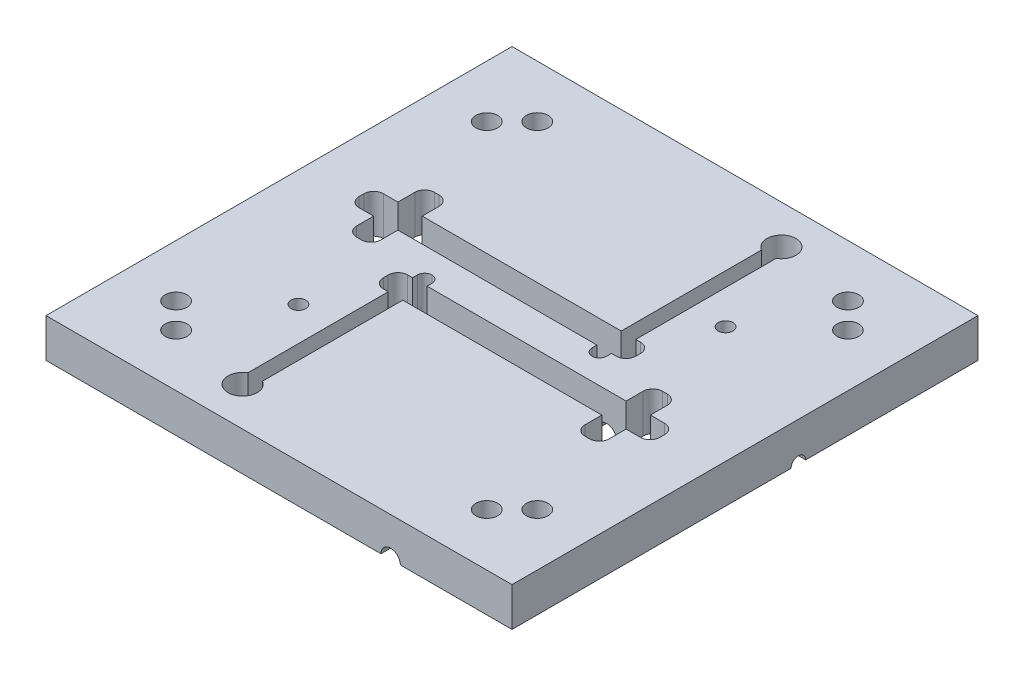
from build123d import *

# Parameters (mm, degrees)
SKETCH1_W           = 304.8
SKETCH1_H           = 304.8
EXTRUDE1_DEPTH      = 12.7
SKETCH2_R           = 7.112
SKETCH2_R_2         = 7.1374
CUT_EXTRUDE1_DEPTH  = 218.017695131
SKETCH3_W           = 15.875
SKETCH3_H           = 50.8
CUT_EXTRUDE2_DEPTH  = 218.017695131
FILLET1_R           = 6.35
FILLET2_R           = 6.35
FILLET3_R           = 6.35
FILLET4_R           = 6.35
SKETCH5_W           = 180.975
SKETCH5_H           = 15.875
CUT_EXTRUDE4_DEPTH  = 218.017695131
FILLET5_R           = 6.35
FILLET6_R           = 6.35
FILLET7_R           = 6.35
FILLET8_R           = 6.35
SKETCH7_R           = 4.7625
CUT_EXTRUDE6_DEPTH  = 127
SKETCH9_R           = 9.525
CUT_EXTRUDE10_DEPTH = 218.017695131
SKETCH12_W          = 15.875
SKETCH12_H          = 50.8
CUT_EXTRUDE13_DEPTH = 218.017695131
FILLET11_R          = 6.35
FILLET12_R          = 6.35
FILLET13_R          = 6.35
FILLET14_R          = 6.35
SKETCH13_W          = 79.248
SKETCH13_H          = 15.875
CUT_EXTRUDE14_DEPTH = 218.017695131
FILLET15_R          = 6.35
FILLET16_R          = 6.35
FILLET17_R          = 6.35
FILLET18_R          = 6.35
SKETCH14_W          = 114.79345596
SKETCH14_H          = 15.875
CUT_EXTRUDE15_DEPTH = 218.017695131
FILLET19_R          = 6.35
FILLET20_R          = 6.35
SKETCH17_R          = 9.525
CUT_EXTRUDE18_DEPTH = 218.017695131
SKETCH18_R          = 6.35
CUT_EXTRUDE19_DEPTH = 177.8
SKETCH19_R          = 6.35
CUT_EXTRUDE20_DEPTH = 177.8
SKETCH21_R          = 4.7625
CUT_EXTRUDE22_DEPTH = 127
SKETCH23_W          = 9.525
SKETCH23_H          = 127
CUT_EXTRUDE23_DEPTH = 218.017695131
FILLET21_R          = 4.7498
FILLET22_R          = 4.7498
SKETCH24_W          = 9.525
SKETCH24_H          = 127
CUT_EXTRUDE24_DEPTH = 218.017695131
FILLET23_R          = 4.7498
FILLET24_R          = 4.7498
SKETCH26_R          = 4.826
CUT_EXTRUDE25_DEPTH = 218.017695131


with BuildPart() as part:
    # Sketch1 → Extrude1 (new, symmetric)
    with BuildSketch(Plane(origin=(0, 0, 0), x_dir=(1, 0, 0), z_dir=(0, 1, 0))):
        Rectangle(SKETCH1_W, SKETCH1_H)
    extrude(amount=EXTRUDE1_DEPTH, both=True)

    # Sketch2 → Cut-Extrude1 (cut, through all)
    with BuildSketch(Plane(origin=(0, 12.7, 0), x_dir=(-1, 0, 0), z_dir=(0, 1, 0))):
        with Locations(Location((118.11, -101.6, 0), (0, 0, 90))):
            Circle(SKETCH2_R)
        with Locations(Location((-118.11, -101.6, 0), (0, 0, 90))):
            Circle(SKETCH2_R)
        with Locations(Location((101.6, -118.11, 0), (0, 0, 90))):
            Circle(SKETCH2_R_2)
        with Locations(Location((-101.6, -118.11, 0), (0, 0, 90))):
            Circle(SKETCH2_R_2)
    cut_extrude1 = extrude(amount=-CUT_EXTRUDE1_DEPTH, mode=Mode.SUBTRACT)

    # Mirror1: Cut-Extrude1 across plane
    add(cut_extrude1.mirror(Plane.XY), mode=Mode.SUBTRACT)

    # Sketch3 → Cut-Extrude2 (cut, through all)
    with BuildSketch(Plane(origin=(0, 12.7, 0), x_dir=(-1, 0, 0), z_dir=(0, 1, 0))):
        with Locations((93.6625, -19.05)):
            Rectangle(SKETCH3_W, SKETCH3_H)
    extrude(amount=-CUT_EXTRUDE2_DEPTH, mode=Mode.SUBTRACT)

    # Fillet1
    fillet1_edges = [part.edges().sort_by_distance(p)[0] for p in [
        (-101.6, 0, -44.45),
    ]]
    fillet(fillet1_edges, radius=FILLET1_R)

    # Fillet2
    fillet2_edges = [part.edges().sort_by_distance(p)[0] for p in [
        (-85.725, 0, -44.45),
    ]]
    fillet(fillet2_edges, radius=FILLET2_R)

    # Fillet3
    fillet3_edges = [part.edges().sort_by_distance(p)[0] for p in [
        (-101.6, 0, 6.35),
    ]]
    fillet(fillet3_edges, radius=FILLET3_R)

    # Fillet4
    fillet4_edges = [part.edges().sort_by_distance(p)[0] for p in [
        (-85.725, 0, 6.35),
    ]]
    fillet(fillet4_edges, radius=FILLET4_R)

    # Sketch5 → Cut-Extrude4 (cut, through all)
    with BuildSketch(Plane(origin=(0, 12.7, 0), x_dir=(-1, 0, 0), z_dir=(0, 1, 0))):
        with Locations((26.9875, -19.0373)):
            Rectangle(SKETCH5_W, SKETCH5_H)
    extrude(amount=-CUT_EXTRUDE4_DEPTH, mode=Mode.SUBTRACT)

    # Fillet5
    fillet5_edges = [part.edges().sort_by_distance(p)[0] for p in [
        (-117.475, 0, -26.9748),
    ]]
    fillet(fillet5_edges, radius=FILLET5_R)

    # Fillet6
    fillet6_edges = [part.edges().sort_by_distance(p)[0] for p in [
        (-117.475, 0, -11.0998),
    ]]
    fillet(fillet6_edges, radius=FILLET6_R)

    # Fillet7
    fillet7_edges = [part.edges().sort_by_distance(p)[0] for p in [
        (63.5, 0, -26.9748),
    ]]
    fillet(fillet7_edges, radius=FILLET7_R)

    # Fillet8
    fillet8_edges = [part.edges().sort_by_distance(p)[0] for p in [
        (63.5, 0, -11.0998),
    ]]
    fillet(fillet8_edges, radius=FILLET8_R)

    # Sketch7 → Cut-Extrude6 (cut)
    with BuildSketch(Plane(origin=(152.4, 0, 0), x_dir=(0, 0, -1), z_dir=(1, 0, 0))):
        with Locations((34.925, -12.7)):
            Circle(SKETCH7_R)
    extrude(amount=-CUT_EXTRUDE6_DEPTH, mode=Mode.SUBTRACT)

    # Sketch9 → Cut-Extrude10 (cut, through all)
    with BuildSketch(Plane(origin=(0, 12.7, 0), x_dir=(-1, 0, 0), z_dir=(0, 1, 0))):
        with Locations(Location((-49.1998, -127, 0), (0, 0, 90))):
            Circle(SKETCH9_R)
    extrude(amount=-CUT_EXTRUDE10_DEPTH, mode=Mode.SUBTRACT)

    # Sketch12 → Cut-Extrude13 (cut, through all)
    with BuildSketch(Plane(origin=(0, 12.7, 0), x_dir=(-1, 0, 0), z_dir=(0, 1, 0))):
        with Locations((-93.6625, 19.05)):
            Rectangle(SKETCH12_W, SKETCH12_H)
    extrude(amount=-CUT_EXTRUDE13_DEPTH, mode=Mode.SUBTRACT)

    # Fillet11
    fillet11_edges = [part.edges().sort_by_distance(p)[0] for p in [
        (85.725, 0, -6.35),
    ]]
    fillet(fillet11_edges, radius=FILLET11_R)

    # Fillet12
    fillet12_edges = [part.edges().sort_by_distance(p)[0] for p in [
        (101.6, 0, -6.35),
    ]]
    fillet(fillet12_edges, radius=FILLET12_R)

    # Fillet13
    fillet13_edges = [part.edges().sort_by_distance(p)[0] for p in [
        (101.6, 0, 44.45),
    ]]
    fillet(fillet13_edges, radius=FILLET13_R)

    # Fillet14
    fillet14_edges = [part.edges().sort_by_distance(p)[0] for p in [
        (85.725, 0, 44.45),
    ]]
    fillet(fillet14_edges, radius=FILLET14_R)

    # Sketch13 → Cut-Extrude14 (cut, through all)
    with BuildSketch(Plane(origin=(0, 12.7, 0), x_dir=(-1, 0, 0), z_dir=(0, 1, 0))):
        with Locations((-77.724, 19.0373)):
            Rectangle(SKETCH13_W, SKETCH13_H)
    extrude(amount=-CUT_EXTRUDE14_DEPTH, mode=Mode.SUBTRACT)

    # Fillet15
    fillet15_edges = [part.edges().sort_by_distance(p)[0] for p in [
        (117.348, 0, 11.0998),
    ]]
    fillet(fillet15_edges, radius=FILLET15_R)

    # Fillet16
    fillet16_edges = [part.edges().sort_by_distance(p)[0] for p in [
        (117.348, 0, 26.9748),
    ]]
    fillet(fillet16_edges, radius=FILLET16_R)

    # Fillet17
    fillet17_edges = [part.edges().sort_by_distance(p)[0] for p in [
        (38.1, 0, 26.9748),
    ]]
    fillet(fillet17_edges, radius=FILLET17_R)

    # Fillet18
    fillet18_edges = [part.edges().sort_by_distance(p)[0] for p in [
        (38.1, 0, 11.0998),
    ]]
    fillet(fillet18_edges, radius=FILLET18_R)

    # Sketch14 → Cut-Extrude15 (cut, through all)
    with BuildSketch(Plane(origin=(0, 12.7, 0), x_dir=(-1, 0, 0), z_dir=(0, 1, 0))):
        with Locations((6.10327202, 19.0373)):
            Rectangle(SKETCH14_W, SKETCH14_H)
    extrude(amount=-CUT_EXTRUDE15_DEPTH, mode=Mode.SUBTRACT)

    # Fillet19
    fillet19_edges = [part.edges().sort_by_distance(p)[0] for p in [
        (-63.5, 0, 11.0998),
    ]]
    fillet(fillet19_edges, radius=FILLET19_R)

    # Fillet20
    fillet20_edges = [part.edges().sort_by_distance(p)[0] for p in [
        (-63.5, 0, 26.9748),
    ]]
    fillet(fillet20_edges, radius=FILLET20_R)

    # Sketch17 → Cut-Extrude18 (cut, through all)
    with BuildSketch(Plane(origin=(0, 12.7, 0), x_dir=(-1, 0, 0), z_dir=(0, 1, 0))):
        with Locations(Location((49.1998, 127, 0), (0, 0, 90))):
            Circle(SKETCH17_R)
    extrude(amount=-CUT_EXTRUDE18_DEPTH, mode=Mode.SUBTRACT)

    # Sketch18 → Cut-Extrude19 (cut)
    with BuildSketch(Plane.XY.offset(152.4)):
        with Locations((73.025, -12.7)):
            Circle(SKETCH18_R)
    extrude(amount=-CUT_EXTRUDE19_DEPTH, mode=Mode.SUBTRACT)

    # Sketch19 → Cut-Extrude20 (cut)
    with BuildSketch(Plane(origin=(0, 0, -152.4), x_dir=(-1, 0, 0), z_dir=(0, 0, -1))):
        with Locations((73.025, -12.7)):
            Circle(SKETCH19_R)
    extrude(amount=-CUT_EXTRUDE20_DEPTH, mode=Mode.SUBTRACT)

    # Sketch21 → Cut-Extrude22 (cut)
    with BuildSketch(Plane.ZY.offset(152.4)):
        with Locations((34.925, -12.7)):
            Circle(SKETCH21_R)
    extrude(amount=-CUT_EXTRUDE22_DEPTH, mode=Mode.SUBTRACT)

    # Sketch23 → Cut-Extrude23 (cut, through all)
    with BuildSketch(Plane(origin=(0, 12.7, 0), x_dir=(-1, 0, 0), z_dir=(0, 1, 0))):
        with Locations((49.2125, 66.675)):
            Rectangle(SKETCH23_W, SKETCH23_H)
    extrude(amount=-CUT_EXTRUDE23_DEPTH, mode=Mode.SUBTRACT)

    # Fillet21
    fillet21_edges = [part.edges().sort_by_distance(p)[0] for p in [
        (-53.975, 0, 3.175),
    ]]
    fillet(fillet21_edges, radius=FILLET21_R)

    # Fillet22
    fillet22_edges = [part.edges().sort_by_distance(p)[0] for p in [
        (-44.45, 0, 3.175),
    ]]
    fillet(fillet22_edges, radius=FILLET22_R)

    # Sketch24 → Cut-Extrude24 (cut, through all)
    with BuildSketch(Plane(origin=(0, 12.7, 0), x_dir=(-1, 0, 0), z_dir=(0, 1, 0))):
        with Locations((-49.2125, -66.675)):
            Rectangle(SKETCH24_W, SKETCH24_H)
    extrude(amount=-CUT_EXTRUDE24_DEPTH, mode=Mode.SUBTRACT)

    # Fillet23
    fillet23_edges = [part.edges().sort_by_distance(p)[0] for p in [
        (44.45, 0, -3.175),
    ]]
    fillet(fillet23_edges, radius=FILLET23_R)

    # Fillet24
    fillet24_edges = [part.edges().sort_by_distance(p)[0] for p in [
        (53.975, 0, -3.175),
    ]]
    fillet(fillet24_edges, radius=FILLET24_R)

    # Sketch26 → Cut-Extrude25 (cut, through all)
    with BuildSketch(Plane.XZ.offset(12.7)):
        with Locations(Location((76.2, -63.5, 0), (0, 0, 270))):
            Circle(SKETCH26_R)
        with Locations(Location((-76.2, 63.5, 0), (0, 0, 270))):
            Circle(SKETCH26_R)
    extrude(amount=-CUT_EXTRUDE25_DEPTH, mode=Mode.SUBTRACT)


solid = part.part
